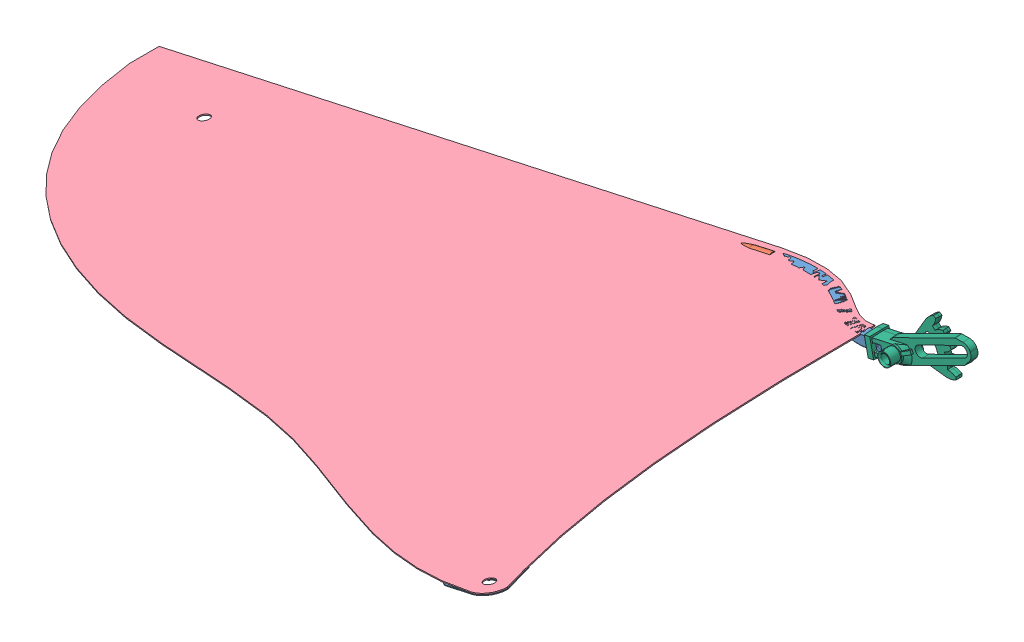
SolidWorks assembly WING_LEFT.sldasm, configuration Default (file format 11000). Lengths in mm.
Overall size (182.88 63.37 117.79).
6 component instances, 6 part files, 3 mates.
Components (placement in the parent):
- WING_STRUCT_LEFT-1: WING_STRUCT_LEFT.sldprt [Default] at origin size (37.75 9.45 13.7)
- WING_CONNECTOR_1-1: WING_CONNECTOR_1.sldprt [Default] at origin size (8.12 3.03 1.7)
- CRP_POLE_06_WING_1-1: CRP_POLE_06_WING_1.sldprt [Default] at origin size (113.43 25.48 0.61)
- WING_FILM_LEFT-1: WING_FILM_LEFT.sldprt [Default] at origin size (182.88 63.37 117.79)
- MYLAR_WASHER_1-1: MYLAR_WASHER_1.sldprt [Default] at origin size (9.31 2.18 10)
- ROCKERCAME_LEFT-1: ROCKERCAME_LEFT.sldprt [Default] at (-0.1953 -0.0429 0.15) size (19.3 10.98 5.51)
Mates (geometry in assembly coordinates):
- Coïncidente1: coincident: plane of WING_STRUCT_LEFT-1 through (-9.8148 0.8449 -2.0612) normal (-0.214527 0.976718 0); plane of ROCKERCAME_LEFT-1 through (-10.4061 0.715 -2.26) normal (0.214527 -0.976718 0)
- Coïncidente2: coincident: line of WING_STRUCT_LEFT-1 through (-10.4843 0.6978 -2.3) axis (-0.976718 -0.214527 0); line of ROCKERCAME_LEFT-1 through (-10.4843 0.6978 -2.3) axis (-0.976718 -0.214527 0)
- Coïncidente3: coincident: line of WING_STRUCT_LEFT-1 through (-10.4843 0.6978 -4.3) axis (0 0 1); plane of ROCKERCAME_LEFT-1 through (-10.0466 -1.2947 -2.26) normal (-0.976718 -0.214527 0)
